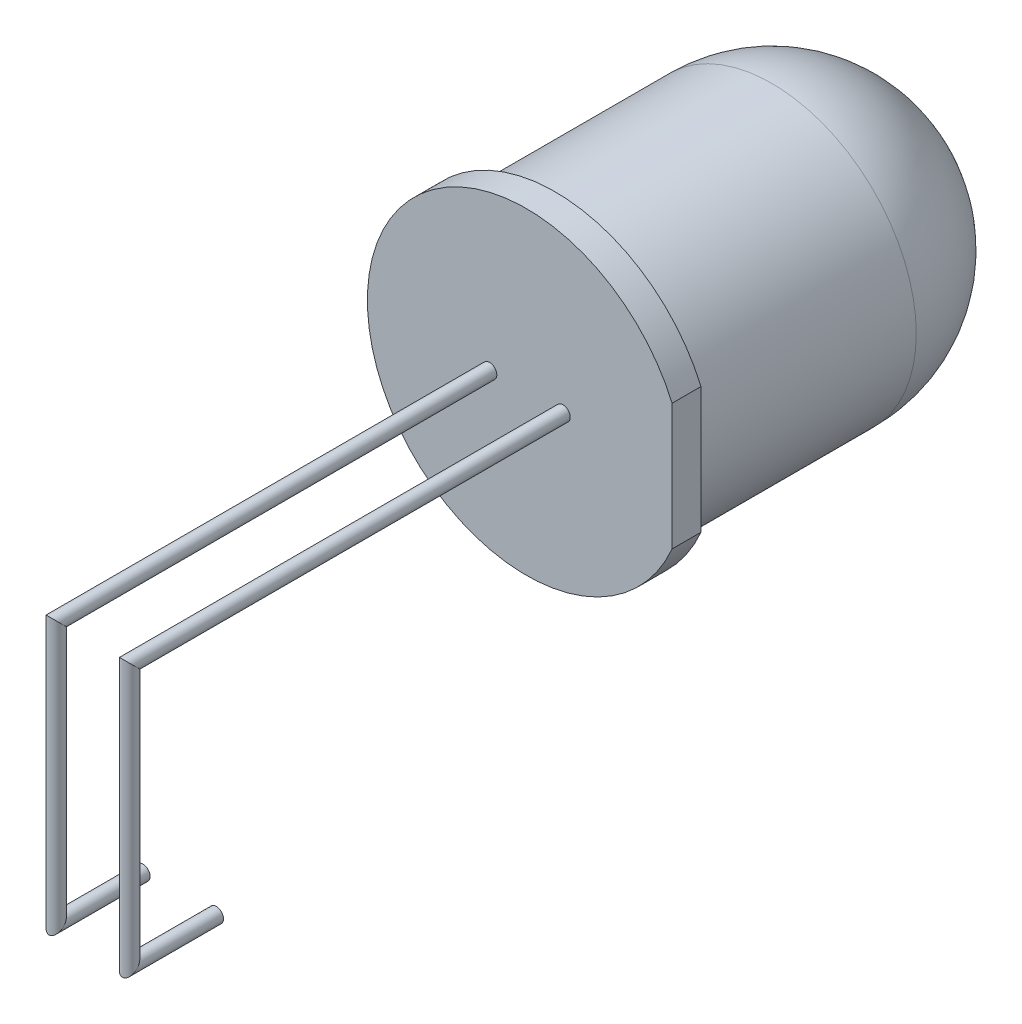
from build123d import *

# Parameters (mm, degrees)
ESQUISSE1_R          = 5
BASE_EXTRUSION_DEPTH = 13.5
BOSS_EXTRU_1_DEPTH   = 1
CONG_1_R             = 5
ESQUISSE3_R          = 0.25


with BuildPart() as part:
    # Esquisse1 → Base-Extrusion (new body)
    with BuildSketch(Plane.XY):
        Circle(ESQUISSE1_R)
    extrude(amount=BASE_EXTRUSION_DEPTH)

    # Esquisse2 → Boss.-Extru.1 (add)
    with BuildSketch(Plane.XY.offset(13.5)):
        with BuildLine():
            Line((5.047640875, 2.184335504), (5.047640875, -2.184335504))
            ThreePointArc((5.047640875, -2.184335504), (-5.5, 0), (5.047640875, 2.184335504))
        make_face()
    extrude(amount=-BOSS_EXTRU_1_DEPTH)

    # Cong_1
    cong_1_edges = [part.edges().sort_by_distance(p)[0] for p in [
        (-5, 0, 0),
    ]]
    fillet(cong_1_edges, radius=CONG_1_R)

    # Balayage1: sweep along a path in Esquisse4
    with BuildLine(Plane(origin=(-1.27, 0, 0), x_dir=(0, 0, -1), z_dir=(1, 0, 0))) as balayage1_path:
        Line((-25.5, -9.04), (-28.5, -9.04))
        Line((-28.5, -9.04), (-28.5, 0))
        Line((-28.5, 0), (-13.5, 0))
    # Esquisse3 → Balayage1 (sweep)
    with BuildSketch(Plane.XY.offset(13.5)):
        with Locations((-1.27, 0)):
            Circle(ESQUISSE3_R)
    balayage1 = sweep(path=balayage1_path.line, transition=Transition.RIGHT)

    # Sym_trie1: Balayage1 across plane
    add(balayage1.mirror(Plane(origin=(0, 0, 0), x_dir=(0, 0, 1), z_dir=(1, 0, 0))))


solid = part.part
